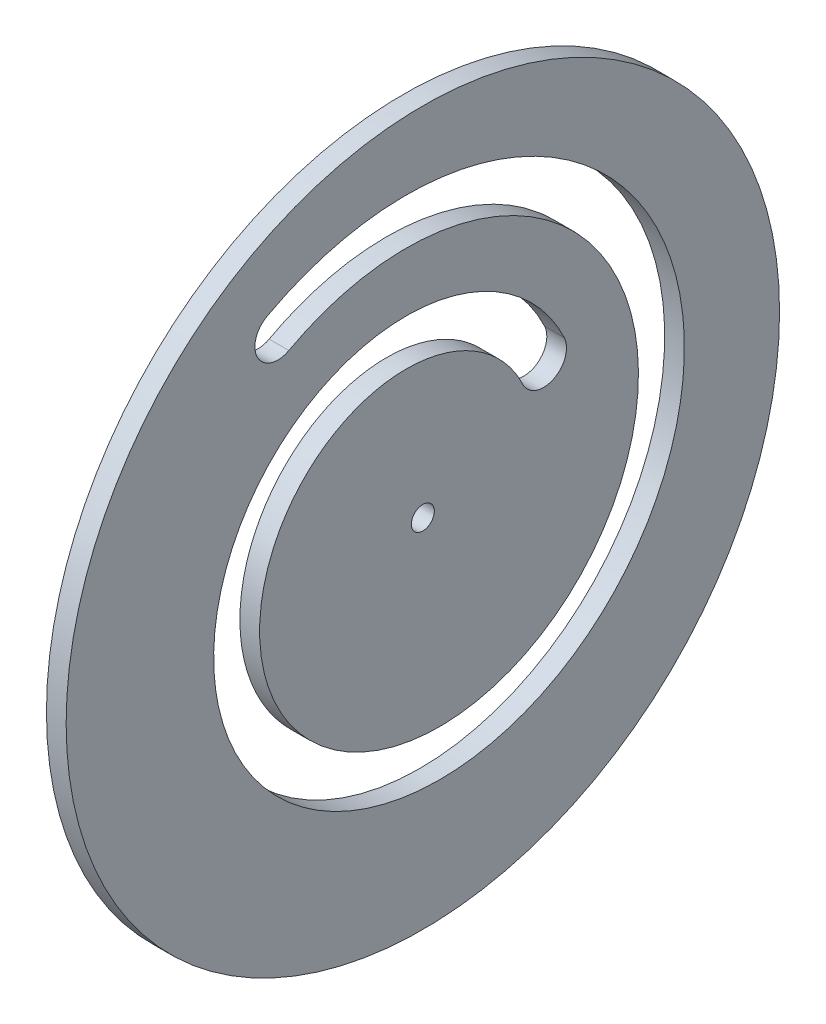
from build123d import *

# Parameters (mm, degrees)
ESQUISSE1_W              = 3
ESQUISSE1_H              = 54.342682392
ENL_V_MAT_EXTRU_10_DEPTH = 77.910690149
ESQUISSE26_R             = 1.75
ENL_V_MAT_EXTRU_19_DEPTH = 77.910690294


with BuildPart() as part:
    # Esquisse1 → R_volution1 (revolve)
    with BuildSketch(Plane.XY, mode=Mode.PRIVATE) as r_volution1_sk:
        with Locations((1.5, 27.171341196)):
            Rectangle(ESQUISSE1_W, ESQUISSE1_H)
    revolve(r_volution1_sk.sketch.rotate(Axis((0, 0, 0), (1, 0, 0)), 90), axis=Axis((0, 0, 0), (1, 0, 0)))

    # Esquisse16 → Enl_v. mat.-Extru.10 (cut, through all)
    with BuildSketch(Plane.ZY.offset(-3)):
        with BuildLine():
            ThreePointArc((-15.220031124, 9.992018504), (-19.880083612, 8.323512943), (-21.548589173, 12.983565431))
            add(Edge.make_bspline(
                [(-21.548589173, 12.983565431), (-20.660721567, 14.8618317), (-19.52955678, 16.648230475), (-16.819447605, 19.930135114), (-15.246446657, 21.418284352), (-11.73070477, 23.992589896), (-9.795516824, 25.073090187), (-5.660941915, 26.742146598), (-3.470248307, 27.3270842), (1.048064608, 27.942983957), (3.3663858, 27.97257657), (7.998370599, 27.448867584), (10.302700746, 26.896519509), (14.759453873, 25.216337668), (16.90307684, 24.09171348), (20.894837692, 21.311671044), (22.735242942, 19.661515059), (25.990104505, 15.910939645), (27.398362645, 13.817508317), (29.68051143, 9.292920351), (30.550110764, 6.870047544), (31.676387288, 1.825073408), (31.930935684, -0.787955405), (31.784578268, -6.056731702), (31.383830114, -8.703171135), (29.924413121, -13.873633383), (28.868173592, -16.388678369), (26.136968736, -21.132857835), (24.466552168, -23.353888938), (20.586815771, -27.358697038), (18.383884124, -29.135735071), (13.555887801, -32.123442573), (10.938660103, -33.329143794), (5.429617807, -35.076276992), (2.546611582, -35.614809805), (-3.32400908, -35.968196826), (-6.302378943, -35.782393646), (-12.181360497, -34.67124065), (-15.072852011, -33.747512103), (-20.594475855, -31.190612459), (-23.216164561, -29.561240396), (-28.024926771, -25.668707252), (-30.204743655, -23.411290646), (-33.978129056, -18.380537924), (-35.566065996, -15.614542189), (-38.035928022, -9.720600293), (-38.914185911, -6.601144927), (-39.885328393, -0.181762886), (-39.976730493, 3.109037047), (-39.341427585, 9.672705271), (-38.615512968, 12.936363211), (-36.362928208, 19.242386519), (-34.83927222, 22.276014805), (-31.059034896, 27.926283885), (-28.807508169, 30.535188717), (-23.687057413, 35.160481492), (-20.824922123, 37.170601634), (-14.640615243, 40.45454101), (-11.326555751, 41.723938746), (-4.428933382, 43.42429745), (-0.854315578, 43.852949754), (6.35170284, 43.81888522), (9.973865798, 43.35611149), (17.05274153, 41.540135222), (20.50054201, 40.189097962), (23.756429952, 38.421024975)],
                knots=[0, 0, 0, 0, 0.03125, 0.03125, 0.0625, 0.0625, 0.09375, 0.09375, 0.125, 0.125, 0.15625, 0.15625, 0.1875, 0.1875, 0.21875, 0.21875, 0.25, 0.25, 0.28125, 0.28125, 0.3125, 0.3125, 0.34375, 0.34375, 0.375, 0.375, 0.40625, 0.40625, 0.4375, 0.4375, 0.46875, 0.46875, 0.5, 0.5, 0.53125, 0.53125, 0.5625, 0.5625, 0.59375, 0.59375, 0.625, 0.625, 0.65625, 0.65625, 0.6875, 0.6875, 0.71875, 0.71875, 0.75, 0.75, 0.78125, 0.78125, 0.8125, 0.8125, 0.84375, 0.84375, 0.875, 0.875, 0.90625, 0.90625, 0.9375, 0.9375, 0.96875, 0.96875, 1, 1, 1, 1], degree=3))
            ThreePointArc((23.756429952, 38.421024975), (25.161930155, 33.675019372), (20.415924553, 32.269519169))
            add(Edge.make_bspline(
                [(-15.220031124, 9.992018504), (-14.581566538, 11.342677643), (-13.760679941, 12.640722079), (-11.793197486, 15.023316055), (-10.640800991, 16.114736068), (-8.065420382, 18.000487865), (-6.635150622, 18.800032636), (-3.580649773, 20.033081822), (-1.948104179, 20.469836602), (1.416800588, 20.928513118), (3.157988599, 20.951538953), (6.63389844, 20.558539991), (8.377421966, 20.141420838), (11.746078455, 18.87144799), (13.379450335, 18.015382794), (16.417423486, 15.899601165), (17.829203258, 14.634764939), (20.322586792, 11.761640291), (21.409878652, 10.146646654), (23.16903258, 6.658948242), (23.844755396, 4.778369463), (24.718096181, 0.866380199), (24.917523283, -1.173588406), (24.803388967, -5.282353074), (24.489486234, -7.359868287), (23.345198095, -11.413883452), (22.512352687, -13.398733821), (20.359751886, -17.13786181), (19.03557745, -18.899616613), (15.962525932, -22.071734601), (14.207547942, -23.488252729), (10.365135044, -25.866051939), (8.270294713, -26.831798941), (3.865768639, -28.228646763), (1.547827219, -28.662261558), (-3.166443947, -28.946041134), (-5.57137621, -28.79662418), (-10.312334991, -27.900562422), (-12.656788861, -27.152223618), (-17.127686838, -25.081883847), (-19.261874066, -23.756187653), (-23.170817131, -20.592028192), (-24.952166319, -18.748099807), (-28.03104927, -14.643271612), (-29.333632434, -12.375473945), (-31.35624134, -7.548832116), (-32.079473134, -4.982079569), (-32.877548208, 0.293303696), (-32.95356719, 3.010371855), (-32.429712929, 8.422602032), (-31.82892122, 11.126219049), (-29.965420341, 16.343017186), (-28.699761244, 18.864160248), (-25.562585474, 23.553254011), (-23.686272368, 25.728194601), (-19.42387273, 29.578411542), (-17.031438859, 31.259287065), (-11.868223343, 34.001014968), (-9.089931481, 35.065742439), (-3.314678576, 36.489421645), (-0.309501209, 36.850296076), (5.740707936, 36.821695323), (8.794164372, 36.432080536), (14.753606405, 34.9032777), (17.667656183, 33.76193511), (20.415924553, 32.269519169)],
                knots=[0, 0, 0, 0, 0.03125, 0.03125, 0.0625, 0.0625, 0.09375, 0.09375, 0.125, 0.125, 0.15625, 0.15625, 0.1875, 0.1875, 0.21875, 0.21875, 0.25, 0.25, 0.28125, 0.28125, 0.3125, 0.3125, 0.34375, 0.34375, 0.375, 0.375, 0.40625, 0.40625, 0.4375, 0.4375, 0.46875, 0.46875, 0.5, 0.5, 0.53125, 0.53125, 0.5625, 0.5625, 0.59375, 0.59375, 0.625, 0.625, 0.65625, 0.65625, 0.6875, 0.6875, 0.71875, 0.71875, 0.75, 0.75, 0.78125, 0.78125, 0.8125, 0.8125, 0.84375, 0.84375, 0.875, 0.875, 0.90625, 0.90625, 0.9375, 0.9375, 0.96875, 0.96875, 1, 1, 1, 1], degree=3))
        make_face()
    extrude(amount=ENL_V_MAT_EXTRU_10_DEPTH, mode=Mode.SUBTRACT)

    # Esquisse26 → Enl_v. mat.-Extru.19 (cut, through all)
    with BuildSketch(Plane(origin=(3, 0, 0), x_dir=(0, 0, -1), z_dir=(1, 0, 0))):
        Circle(ESQUISSE26_R)
    extrude(amount=-ENL_V_MAT_EXTRU_19_DEPTH, mode=Mode.SUBTRACT)


solid = part.part
